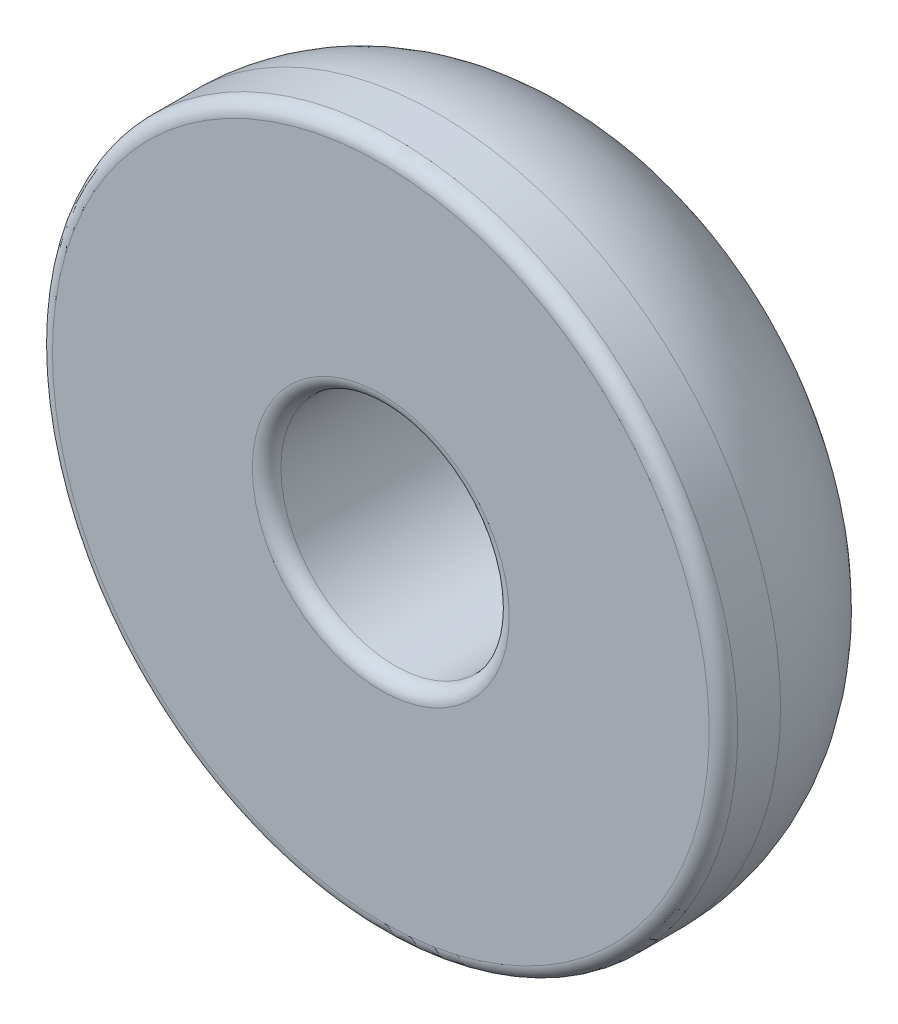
ISO-10303-21;
HEADER;
FILE_DESCRIPTION(('STEP AP214'),'2;1');
FILE_NAME('part.step','',(''),(''),'','','');
FILE_SCHEMA(('AUTOMOTIVE_DESIGN { 1 0 10303 214 1 1 1 1 }'));
ENDSEC;
DATA;
#1=APPLICATION_CONTEXT('core data for automotive mechanical design processes');
#2=APPLICATION_PROTOCOL_DEFINITION('international standard','automotive_design',2000,#1);
#3=PRODUCT_CONTEXT('',#1,'mechanical');
#4=PRODUCT('Part','Part','',(#3));
#5=PRODUCT_RELATED_PRODUCT_CATEGORY('part','',(#4));
#6=PRODUCT_DEFINITION_FORMATION('','',#4);
#7=PRODUCT_DEFINITION_CONTEXT('part definition',#1,'design');
#8=PRODUCT_DEFINITION('design','',#6,#7);
#9=PRODUCT_DEFINITION_SHAPE('','',#8);
#10=(LENGTH_UNIT() NAMED_UNIT(*) SI_UNIT(.MILLI.,.METRE.));
#11=(NAMED_UNIT(*) PLANE_ANGLE_UNIT() SI_UNIT($,.RADIAN.));
#12=(NAMED_UNIT(*) SI_UNIT($,.STERADIAN.) SOLID_ANGLE_UNIT());
#13=UNCERTAINTY_MEASURE_WITH_UNIT(LENGTH_MEASURE(1.E-05),#10,'distance_accuracy_value','');
#14=(GEOMETRIC_REPRESENTATION_CONTEXT(3) GLOBAL_UNCERTAINTY_ASSIGNED_CONTEXT((#13)) GLOBAL_UNIT_ASSIGNED_CONTEXT((#10,
#11,#12)) REPRESENTATION_CONTEXT('',''));
#15=CARTESIAN_POINT('',(0.,0.,0.));
#16=DIRECTION('',(0.,0.,1.));
#17=DIRECTION('',(1.,0.,0.));
#18=AXIS2_PLACEMENT_3D('',#15,#16,#17);
#19=CARTESIAN_POINT('',(0.,5.99999999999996,-4.));
#20=DIRECTION('',(0.,0.,1.));
#21=DIRECTION('',(1.,0.,0.));
#22=AXIS2_PLACEMENT_3D('',#19,#20,#21);
#23=PLANE('',#22);
#24=CARTESIAN_POINT('',(0.,0.,-4.));
#25=DIRECTION('',(0.,0.,1.));
#26=DIRECTION('',(1.,0.,0.));
#27=AXIS2_PLACEMENT_3D('',#24,#25,#26);
#28=CIRCLE('',#27,4.5);
#29=CARTESIAN_POINT('',(4.5,0.,-4.));
#30=VERTEX_POINT('',#29);
#31=EDGE_CURVE('E36',#30,#30,#28,.T.);
#32=ORIENTED_EDGE('',*,*,#31,.T.);
#33=EDGE_LOOP('',(#32));
#34=FACE_BOUND('',#33,.T.);
#35=CARTESIAN_POINT('',(0.,0.,-4.));
#36=DIRECTION('',(0.,0.,1.));
#37=DIRECTION('',(1.,0.,0.));
#38=AXIS2_PLACEMENT_3D('',#35,#36,#37);
#39=CIRCLE('',#38,5.99999999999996);
#40=CARTESIAN_POINT('',(5.99999999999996,0.,-4.));
#41=VERTEX_POINT('',#40);
#42=EDGE_CURVE('E58',#41,#41,#39,.T.);
#43=ORIENTED_EDGE('',*,*,#42,.F.);
#44=EDGE_LOOP('',(#43));
#45=FACE_BOUND('',#44,.T.);
#46=ADVANCED_FACE('F29',(#34,#45),#23,.F.);
#47=CARTESIAN_POINT('',(0.,0.,4.));
#48=DIRECTION('',(0.,0.,1.));
#49=DIRECTION('',(1.,0.,0.));
#50=AXIS2_PLACEMENT_3D('',#47,#48,#49);
#51=CYLINDRICAL_SURFACE('',#50,4.);
#52=CARTESIAN_POINT('',(0.,0.,3.5));
#53=DIRECTION('',(0.,0.,-1.));
#54=DIRECTION('',(-1.,0.,0.));
#55=AXIS2_PLACEMENT_3D('',#52,#53,#54);
#56=CIRCLE('',#55,4.);
#57=CARTESIAN_POINT('',(-4.,0.,3.5));
#58=VERTEX_POINT('',#57);
#59=EDGE_CURVE('E49',#58,#58,#56,.F.);
#60=ORIENTED_EDGE('',*,*,#59,.T.);
#61=EDGE_LOOP('',(#60));
#62=FACE_BOUND('',#61,.T.);
#63=CARTESIAN_POINT('',(0.,0.,-3.5));
#64=DIRECTION('',(0.,0.,1.));
#65=DIRECTION('',(1.,0.,0.));
#66=AXIS2_PLACEMENT_3D('',#63,#64,#65);
#67=CIRCLE('',#66,4.);
#68=CARTESIAN_POINT('',(4.,0.,-3.5));
#69=VERTEX_POINT('',#68);
#70=EDGE_CURVE('E52',#69,#69,#67,.F.);
#71=ORIENTED_EDGE('',*,*,#70,.T.);
#72=EDGE_LOOP('',(#71));
#73=FACE_BOUND('',#72,.T.);
#74=ADVANCED_FACE('F65',(#62,#73),#51,.F.);
#75=CARTESIAN_POINT('',(0.,4.,4.));
#76=DIRECTION('',(0.,0.,-1.));
#77=DIRECTION('',(-1.,0.,0.));
#78=AXIS2_PLACEMENT_3D('',#75,#76,#77);
#79=PLANE('',#78);
#80=CARTESIAN_POINT('',(0.,0.,4.));
#81=DIRECTION('',(0.,0.,-1.));
#82=DIRECTION('',(-1.,0.,0.));
#83=AXIS2_PLACEMENT_3D('',#80,#81,#82);
#84=CIRCLE('',#83,4.5);
#85=CARTESIAN_POINT('',(-4.5,0.,4.));
#86=VERTEX_POINT('',#85);
#87=EDGE_CURVE('E40',#86,#86,#84,.T.);
#88=ORIENTED_EDGE('',*,*,#87,.T.);
#89=EDGE_LOOP('',(#88));
#90=FACE_BOUND('',#89,.T.);
#91=CARTESIAN_POINT('',(0.,0.,4.));
#92=DIRECTION('',(0.,0.,-1.));
#93=DIRECTION('',(-1.,0.,0.));
#94=AXIS2_PLACEMENT_3D('',#91,#92,#93);
#95=CIRCLE('',#94,11.5);
#96=CARTESIAN_POINT('',(-11.5,0.,4.));
#97=VERTEX_POINT('',#96);
#98=EDGE_CURVE('E44',#97,#97,#95,.F.);
#99=ORIENTED_EDGE('',*,*,#98,.T.);
#100=EDGE_LOOP('',(#99));
#101=FACE_BOUND('',#100,.T.);
#102=ADVANCED_FACE('F70',(#90,#101),#79,.F.);
#103=CARTESIAN_POINT('',(0.,0.,4.));
#104=DIRECTION('',(0.,0.,1.));
#105=DIRECTION('',(1.,0.,0.));
#106=AXIS2_PLACEMENT_3D('',#103,#104,#105);
#107=CYLINDRICAL_SURFACE('',#106,12.);
#108=CARTESIAN_POINT('',(0.,0.,3.5));
#109=DIRECTION('',(0.,0.,-1.));
#110=DIRECTION('',(-1.,0.,0.));
#111=AXIS2_PLACEMENT_3D('',#108,#109,#110);
#112=CIRCLE('',#111,12.);
#113=CARTESIAN_POINT('',(-12.,0.,3.5));
#114=VERTEX_POINT('',#113);
#115=EDGE_CURVE('E10',#114,#114,#112,.T.);
#116=ORIENTED_EDGE('',*,*,#115,.T.);
#117=EDGE_LOOP('',(#116));
#118=FACE_BOUND('',#117,.T.);
#119=CARTESIAN_POINT('',(0.,0.,2.00000000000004));
#120=DIRECTION('',(0.,0.,1.));
#121=DIRECTION('',(1.,0.,0.));
#122=AXIS2_PLACEMENT_3D('',#119,#120,#121);
#123=CIRCLE('',#122,12.);
#124=CARTESIAN_POINT('',(12.,0.,2.00000000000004));
#125=VERTEX_POINT('',#124);
#126=EDGE_CURVE('E55',#125,#125,#123,.T.);
#127=ORIENTED_EDGE('',*,*,#126,.T.);
#128=EDGE_LOOP('',(#127));
#129=FACE_BOUND('',#128,.T.);
#130=ADVANCED_FACE('F94',(#118,#129),#107,.T.);
#131=CARTESIAN_POINT('',(0.,0.,2.));
#132=DIRECTION('',(0.,0.,1.));
#133=DIRECTION('',(1.,0.,0.));
#134=AXIS2_PLACEMENT_3D('',#131,#132,#133);
#135=DEGENERATE_TOROIDAL_SURFACE('',#134,6.,6.,.T.);
#136=ORIENTED_EDGE('',*,*,#126,.F.);
#137=EDGE_LOOP('',(#136));
#138=FACE_BOUND('',#137,.T.);
#139=ORIENTED_EDGE('',*,*,#42,.T.);
#140=EDGE_LOOP('',(#139));
#141=FACE_BOUND('',#140,.T.);
#142=ADVANCED_FACE('F62',(#138,#141),#135,.T.);
#143=CARTESIAN_POINT('',(0.,0.,3.5));
#144=DIRECTION('',(0.,0.,-1.));
#145=DIRECTION('',(-1.,0.,0.));
#146=AXIS2_PLACEMENT_3D('',#143,#144,#145);
#147=TOROIDAL_SURFACE('',#146,4.5,0.5);
#148=ORIENTED_EDGE('',*,*,#87,.F.);
#149=EDGE_LOOP('',(#148));
#150=FACE_BOUND('',#149,.T.);
#151=ORIENTED_EDGE('',*,*,#59,.F.);
#152=EDGE_LOOP('',(#151));
#153=FACE_BOUND('',#152,.T.);
#154=ADVANCED_FACE('F75',(#150,#153),#147,.T.);
#155=CARTESIAN_POINT('',(0.,0.,-3.5));
#156=DIRECTION('',(0.,0.,1.));
#157=DIRECTION('',(1.,0.,0.));
#158=AXIS2_PLACEMENT_3D('',#155,#156,#157);
#159=TOROIDAL_SURFACE('',#158,4.5,0.5);
#160=ORIENTED_EDGE('',*,*,#70,.F.);
#161=EDGE_LOOP('',(#160));
#162=FACE_BOUND('',#161,.T.);
#163=ORIENTED_EDGE('',*,*,#31,.F.);
#164=EDGE_LOOP('',(#163));
#165=FACE_BOUND('',#164,.T.);
#166=ADVANCED_FACE('F77',(#162,#165),#159,.T.);
#167=CARTESIAN_POINT('',(0.,0.,3.5));
#168=DIRECTION('',(0.,0.,-1.));
#169=DIRECTION('',(-1.,0.,0.));
#170=AXIS2_PLACEMENT_3D('',#167,#168,#169);
#171=TOROIDAL_SURFACE('',#170,11.5,0.5);
#172=ORIENTED_EDGE('',*,*,#115,.F.);
#173=EDGE_LOOP('',(#172));
#174=FACE_BOUND('',#173,.T.);
#175=ORIENTED_EDGE('',*,*,#98,.F.);
#176=EDGE_LOOP('',(#175));
#177=FACE_BOUND('',#176,.T.);
#178=ADVANCED_FACE('F31',(#174,#177),#171,.T.);
#179=CLOSED_SHELL('',(#46,#74,#102,#130,#142,#154,#166,#178));
#180=MANIFOLD_SOLID_BREP('B2',#179);
#181=ADVANCED_BREP_SHAPE_REPRESENTATION('',(#18,#180),#14);
#182=SHAPE_DEFINITION_REPRESENTATION(#9,#181);
ENDSEC;
END-ISO-10303-21;
